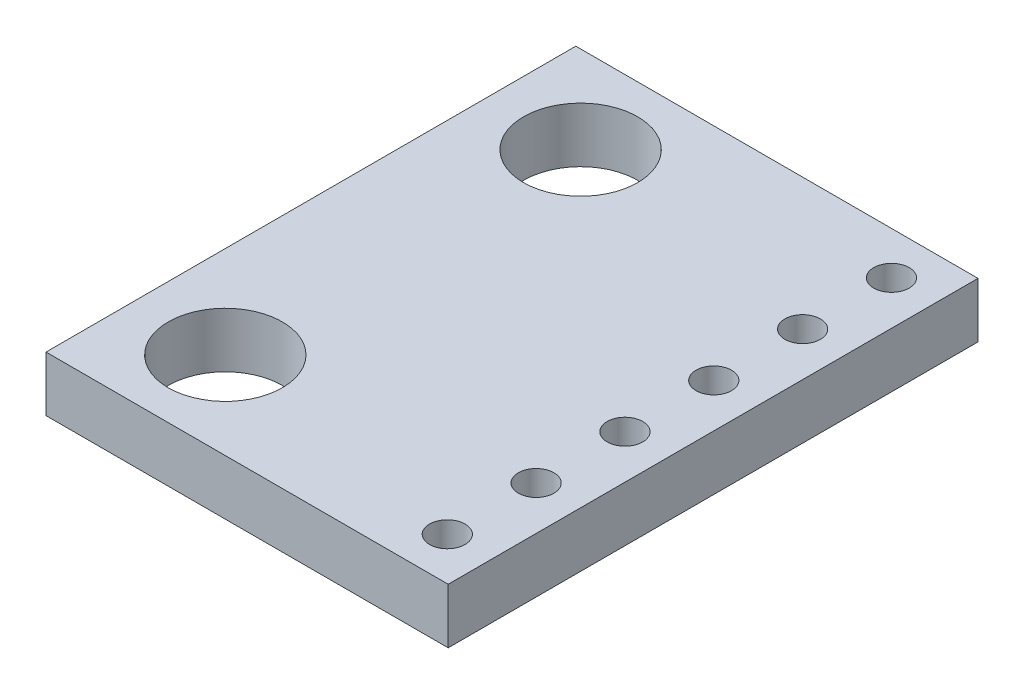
ISO-10303-21;
HEADER;
FILE_DESCRIPTION(('STEP AP214'),'2;1');
FILE_NAME('part.step','',(''),(''),'','','');
FILE_SCHEMA(('AUTOMOTIVE_DESIGN { 1 0 10303 214 1 1 1 1 }'));
ENDSEC;
DATA;
#1=APPLICATION_CONTEXT('core data for automotive mechanical design processes');
#2=APPLICATION_PROTOCOL_DEFINITION('international standard','automotive_design',2000,#1);
#3=PRODUCT_CONTEXT('',#1,'mechanical');
#4=PRODUCT('Part','Part','',(#3));
#5=PRODUCT_RELATED_PRODUCT_CATEGORY('part','',(#4));
#6=PRODUCT_DEFINITION_FORMATION('','',#4);
#7=PRODUCT_DEFINITION_CONTEXT('part definition',#1,'design');
#8=PRODUCT_DEFINITION('design','',#6,#7);
#9=PRODUCT_DEFINITION_SHAPE('','',#8);
#10=(LENGTH_UNIT() NAMED_UNIT(*) SI_UNIT(.MILLI.,.METRE.));
#11=(NAMED_UNIT(*) PLANE_ANGLE_UNIT() SI_UNIT($,.RADIAN.));
#12=(NAMED_UNIT(*) SI_UNIT($,.STERADIAN.) SOLID_ANGLE_UNIT());
#13=UNCERTAINTY_MEASURE_WITH_UNIT(LENGTH_MEASURE(1.E-05),#10,'distance_accuracy_value','');
#14=(GEOMETRIC_REPRESENTATION_CONTEXT(3) GLOBAL_UNCERTAINTY_ASSIGNED_CONTEXT((#13)) GLOBAL_UNIT_ASSIGNED_CONTEXT((#10,
#11,#12)) REPRESENTATION_CONTEXT('',''));
#15=CARTESIAN_POINT('',(0.,0.,0.));
#16=DIRECTION('',(0.,0.,1.));
#17=DIRECTION('',(1.,0.,0.));
#18=AXIS2_PLACEMENT_3D('',#15,#16,#17);
#19=CARTESIAN_POINT('',(0.,1.5748,0.));
#20=DIRECTION('',(0.,-1.,0.));
#21=DIRECTION('',(0.,0.,-1.));
#22=AXIS2_PLACEMENT_3D('',#19,#20,#21);
#23=PLANE('',#22);
#24=DIRECTION('',(0.,0.,1.));
#25=VECTOR('',#24,1.);
#26=CARTESIAN_POINT('',(0.,1.5748,0.));
#27=LINE('',#26,#25);
#28=CARTESIAN_POINT('',(0.,1.5748,-15.15));
#29=VERTEX_POINT('',#28);
#30=CARTESIAN_POINT('',(0.,1.5748,0.));
#31=VERTEX_POINT('',#30);
#32=EDGE_CURVE('E94',#29,#31,#27,.T.);
#33=ORIENTED_EDGE('',*,*,#32,.T.);
#34=DIRECTION('',(1.,0.,0.));
#35=VECTOR('',#34,1.);
#36=CARTESIAN_POINT('',(0.,1.5748,0.));
#37=LINE('',#36,#35);
#38=CARTESIAN_POINT('',(11.5,1.5748,0.));
#39=VERTEX_POINT('',#38);
#40=EDGE_CURVE('E89',#31,#39,#37,.T.);
#41=ORIENTED_EDGE('',*,*,#40,.T.);
#42=DIRECTION('',(0.,0.,-1.));
#43=VECTOR('',#42,1.);
#44=CARTESIAN_POINT('',(11.5,1.5748,0.));
#45=LINE('',#44,#43);
#46=CARTESIAN_POINT('',(11.5,1.5748,-15.15));
#47=VERTEX_POINT('',#46);
#48=EDGE_CURVE('E92',#39,#47,#45,.T.);
#49=ORIENTED_EDGE('',*,*,#48,.T.);
#50=DIRECTION('',(-1.,0.,0.));
#51=VECTOR('',#50,1.);
#52=CARTESIAN_POINT('',(0.,1.5748,-15.15));
#53=LINE('',#52,#51);
#54=EDGE_CURVE('E59',#47,#29,#53,.T.);
#55=ORIENTED_EDGE('',*,*,#54,.T.);
#56=EDGE_LOOP('',(#33,#41,#49,#55));
#57=FACE_BOUND('',#56,.T.);
#58=CARTESIAN_POINT('',(2.63195,1.5748,-12.655));
#59=DIRECTION('',(0.,1.,0.));
#60=DIRECTION('',(0.,0.,1.));
#61=AXIS2_PLACEMENT_3D('',#58,#59,#60);
#62=CIRCLE('',#61,1.63195);
#63=CARTESIAN_POINT('',(2.63195,1.5748,-11.02305));
#64=VERTEX_POINT('',#63);
#65=EDGE_CURVE('E109',#64,#64,#62,.T.);
#66=ORIENTED_EDGE('',*,*,#65,.F.);
#67=EDGE_LOOP('',(#66));
#68=FACE_BOUND('',#67,.T.);
#69=CARTESIAN_POINT('',(2.63195,1.5748,-2.495));
#70=DIRECTION('',(0.,1.,0.));
#71=DIRECTION('',(0.,0.,1.));
#72=AXIS2_PLACEMENT_3D('',#69,#70,#71);
#73=CIRCLE('',#72,1.63195);
#74=CARTESIAN_POINT('',(2.63195,1.5748,-0.863049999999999));
#75=VERTEX_POINT('',#74);
#76=EDGE_CURVE('E124',#75,#75,#73,.T.);
#77=ORIENTED_EDGE('',*,*,#76,.F.);
#78=EDGE_LOOP('',(#77));
#79=FACE_BOUND('',#78,.T.);
#80=CARTESIAN_POINT('',(10.25,1.5748,-13.925));
#81=DIRECTION('',(0.,1.,0.));
#82=DIRECTION('',(0.,0.,1.));
#83=AXIS2_PLACEMENT_3D('',#80,#81,#82);
#84=CIRCLE('',#83,0.508);
#85=CARTESIAN_POINT('',(10.25,1.5748,-13.417));
#86=VERTEX_POINT('',#85);
#87=EDGE_CURVE('E130',#86,#86,#84,.T.);
#88=ORIENTED_EDGE('',*,*,#87,.F.);
#89=EDGE_LOOP('',(#88));
#90=FACE_BOUND('',#89,.T.);
#91=CARTESIAN_POINT('',(10.25,1.5748,-11.385));
#92=DIRECTION('',(0.,1.,0.));
#93=DIRECTION('',(0.,0.,1.));
#94=AXIS2_PLACEMENT_3D('',#91,#92,#93);
#95=CIRCLE('',#94,0.508);
#96=CARTESIAN_POINT('',(10.25,1.5748,-10.877));
#97=VERTEX_POINT('',#96);
#98=EDGE_CURVE('E136',#97,#97,#95,.T.);
#99=ORIENTED_EDGE('',*,*,#98,.F.);
#100=EDGE_LOOP('',(#99));
#101=FACE_BOUND('',#100,.T.);
#102=CARTESIAN_POINT('',(10.25,1.5748,-8.845));
#103=DIRECTION('',(0.,1.,0.));
#104=DIRECTION('',(0.,0.,1.));
#105=AXIS2_PLACEMENT_3D('',#102,#103,#104);
#106=CIRCLE('',#105,0.508);
#107=CARTESIAN_POINT('',(10.25,1.5748,-8.337));
#108=VERTEX_POINT('',#107);
#109=EDGE_CURVE('E142',#108,#108,#106,.T.);
#110=ORIENTED_EDGE('',*,*,#109,.F.);
#111=EDGE_LOOP('',(#110));
#112=FACE_BOUND('',#111,.T.);
#113=CARTESIAN_POINT('',(10.25,1.5748,-6.305));
#114=DIRECTION('',(0.,1.,0.));
#115=DIRECTION('',(0.,0.,1.));
#116=AXIS2_PLACEMENT_3D('',#113,#114,#115);
#117=CIRCLE('',#116,0.508);
#118=CARTESIAN_POINT('',(10.25,1.5748,-5.797));
#119=VERTEX_POINT('',#118);
#120=EDGE_CURVE('E148',#119,#119,#117,.T.);
#121=ORIENTED_EDGE('',*,*,#120,.F.);
#122=EDGE_LOOP('',(#121));
#123=FACE_BOUND('',#122,.T.);
#124=CARTESIAN_POINT('',(10.25,1.5748,-3.765));
#125=DIRECTION('',(0.,1.,0.));
#126=DIRECTION('',(0.,0.,1.));
#127=AXIS2_PLACEMENT_3D('',#124,#125,#126);
#128=CIRCLE('',#127,0.508);
#129=CARTESIAN_POINT('',(10.25,1.5748,-3.257));
#130=VERTEX_POINT('',#129);
#131=EDGE_CURVE('E154',#130,#130,#128,.T.);
#132=ORIENTED_EDGE('',*,*,#131,.F.);
#133=EDGE_LOOP('',(#132));
#134=FACE_BOUND('',#133,.T.);
#135=CARTESIAN_POINT('',(10.25,1.5748,-1.225));
#136=DIRECTION('',(0.,1.,0.));
#137=DIRECTION('',(0.,0.,1.));
#138=AXIS2_PLACEMENT_3D('',#135,#136,#137);
#139=CIRCLE('',#138,0.508);
#140=CARTESIAN_POINT('',(10.25,1.5748,-0.717));
#141=VERTEX_POINT('',#140);
#142=EDGE_CURVE('E160',#141,#141,#139,.T.);
#143=ORIENTED_EDGE('',*,*,#142,.F.);
#144=EDGE_LOOP('',(#143));
#145=FACE_BOUND('',#144,.T.);
#146=ADVANCED_FACE('F42',(#57,#68,#79,#90,#101,#112,#123,#134,#145),#23,.F.);
#147=CARTESIAN_POINT('',(0.,0.,0.));
#148=DIRECTION('',(0.,-1.,0.));
#149=DIRECTION('',(0.,0.,-1.));
#150=AXIS2_PLACEMENT_3D('',#147,#148,#149);
#151=PLANE('',#150);
#152=CARTESIAN_POINT('',(10.25,0.,-3.765));
#153=DIRECTION('',(0.,1.,0.));
#154=DIRECTION('',(0.,0.,1.));
#155=AXIS2_PLACEMENT_3D('',#152,#153,#154);
#156=CIRCLE('',#155,0.508);
#157=CARTESIAN_POINT('',(10.25,0.,-3.257));
#158=VERTEX_POINT('',#157);
#159=EDGE_CURVE('E157',#158,#158,#156,.T.);
#160=ORIENTED_EDGE('',*,*,#159,.T.);
#161=EDGE_LOOP('',(#160));
#162=FACE_BOUND('',#161,.T.);
#163=CARTESIAN_POINT('',(10.25,0.,-8.845));
#164=DIRECTION('',(0.,1.,0.));
#165=DIRECTION('',(0.,0.,1.));
#166=AXIS2_PLACEMENT_3D('',#163,#164,#165);
#167=CIRCLE('',#166,0.508);
#168=CARTESIAN_POINT('',(10.25,0.,-8.337));
#169=VERTEX_POINT('',#168);
#170=EDGE_CURVE('E145',#169,#169,#167,.T.);
#171=ORIENTED_EDGE('',*,*,#170,.T.);
#172=EDGE_LOOP('',(#171));
#173=FACE_BOUND('',#172,.T.);
#174=CARTESIAN_POINT('',(10.25,0.,-13.925));
#175=DIRECTION('',(0.,1.,0.));
#176=DIRECTION('',(0.,0.,1.));
#177=AXIS2_PLACEMENT_3D('',#174,#175,#176);
#178=CIRCLE('',#177,0.508);
#179=CARTESIAN_POINT('',(10.25,0.,-13.417));
#180=VERTEX_POINT('',#179);
#181=EDGE_CURVE('E133',#180,#180,#178,.T.);
#182=ORIENTED_EDGE('',*,*,#181,.T.);
#183=EDGE_LOOP('',(#182));
#184=FACE_BOUND('',#183,.T.);
#185=CARTESIAN_POINT('',(2.63195,0.,-12.655));
#186=DIRECTION('',(0.,1.,0.));
#187=DIRECTION('',(0.,0.,1.));
#188=AXIS2_PLACEMENT_3D('',#185,#186,#187);
#189=CIRCLE('',#188,1.63195);
#190=CARTESIAN_POINT('',(2.63195,0.,-11.02305));
#191=VERTEX_POINT('',#190);
#192=EDGE_CURVE('E121',#191,#191,#189,.T.);
#193=ORIENTED_EDGE('',*,*,#192,.T.);
#194=EDGE_LOOP('',(#193));
#195=FACE_BOUND('',#194,.T.);
#196=DIRECTION('',(0.,0.,1.));
#197=VECTOR('',#196,1.);
#198=CARTESIAN_POINT('',(0.,0.,0.));
#199=LINE('',#198,#197);
#200=CARTESIAN_POINT('',(0.,0.,-15.15));
#201=VERTEX_POINT('',#200);
#202=CARTESIAN_POINT('',(0.,0.,0.));
#203=VERTEX_POINT('',#202);
#204=EDGE_CURVE('E106',#201,#203,#199,.T.);
#205=ORIENTED_EDGE('',*,*,#204,.F.);
#206=DIRECTION('',(-1.,0.,0.));
#207=VECTOR('',#206,1.);
#208=CARTESIAN_POINT('',(0.,0.,-15.15));
#209=LINE('',#208,#207);
#210=CARTESIAN_POINT('',(11.5,0.,-15.15));
#211=VERTEX_POINT('',#210);
#212=EDGE_CURVE('E82',#211,#201,#209,.T.);
#213=ORIENTED_EDGE('',*,*,#212,.F.);
#214=DIRECTION('',(0.,0.,-1.));
#215=VECTOR('',#214,1.);
#216=CARTESIAN_POINT('',(11.5,0.,0.));
#217=LINE('',#216,#215);
#218=CARTESIAN_POINT('',(11.5,0.,0.));
#219=VERTEX_POINT('',#218);
#220=EDGE_CURVE('E76',#219,#211,#217,.T.);
#221=ORIENTED_EDGE('',*,*,#220,.F.);
#222=DIRECTION('',(1.,0.,0.));
#223=VECTOR('',#222,1.);
#224=CARTESIAN_POINT('',(0.,0.,0.));
#225=LINE('',#224,#223);
#226=EDGE_CURVE('E98',#203,#219,#225,.T.);
#227=ORIENTED_EDGE('',*,*,#226,.F.);
#228=EDGE_LOOP('',(#205,#213,#221,#227));
#229=FACE_BOUND('',#228,.T.);
#230=CARTESIAN_POINT('',(2.63195,0.,-2.495));
#231=DIRECTION('',(0.,1.,0.));
#232=DIRECTION('',(0.,0.,1.));
#233=AXIS2_PLACEMENT_3D('',#230,#231,#232);
#234=CIRCLE('',#233,1.63195);
#235=CARTESIAN_POINT('',(2.63195,0.,-0.863049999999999));
#236=VERTEX_POINT('',#235);
#237=EDGE_CURVE('E127',#236,#236,#234,.T.);
#238=ORIENTED_EDGE('',*,*,#237,.T.);
#239=EDGE_LOOP('',(#238));
#240=FACE_BOUND('',#239,.T.);
#241=CARTESIAN_POINT('',(10.25,0.,-11.385));
#242=DIRECTION('',(0.,1.,0.));
#243=DIRECTION('',(0.,0.,1.));
#244=AXIS2_PLACEMENT_3D('',#241,#242,#243);
#245=CIRCLE('',#244,0.508);
#246=CARTESIAN_POINT('',(10.25,0.,-10.877));
#247=VERTEX_POINT('',#246);
#248=EDGE_CURVE('E139',#247,#247,#245,.T.);
#249=ORIENTED_EDGE('',*,*,#248,.T.);
#250=EDGE_LOOP('',(#249));
#251=FACE_BOUND('',#250,.T.);
#252=CARTESIAN_POINT('',(10.25,0.,-6.305));
#253=DIRECTION('',(0.,1.,0.));
#254=DIRECTION('',(0.,0.,1.));
#255=AXIS2_PLACEMENT_3D('',#252,#253,#254);
#256=CIRCLE('',#255,0.508);
#257=CARTESIAN_POINT('',(10.25,0.,-5.797));
#258=VERTEX_POINT('',#257);
#259=EDGE_CURVE('E151',#258,#258,#256,.T.);
#260=ORIENTED_EDGE('',*,*,#259,.T.);
#261=EDGE_LOOP('',(#260));
#262=FACE_BOUND('',#261,.T.);
#263=CARTESIAN_POINT('',(10.25,0.,-1.225));
#264=DIRECTION('',(0.,1.,0.));
#265=DIRECTION('',(0.,0.,1.));
#266=AXIS2_PLACEMENT_3D('',#263,#264,#265);
#267=CIRCLE('',#266,0.508);
#268=CARTESIAN_POINT('',(10.25,0.,-0.717));
#269=VERTEX_POINT('',#268);
#270=EDGE_CURVE('E163',#269,#269,#267,.T.);
#271=ORIENTED_EDGE('',*,*,#270,.T.);
#272=EDGE_LOOP('',(#271));
#273=FACE_BOUND('',#272,.T.);
#274=ADVANCED_FACE('F117',(#162,#173,#184,#195,#229,#240,#251,#262,#273),#151,.T.);
#275=CARTESIAN_POINT('',(0.,1.5748,0.));
#276=DIRECTION('',(1.,0.,0.));
#277=DIRECTION('',(0.,0.,-1.));
#278=AXIS2_PLACEMENT_3D('',#275,#276,#277);
#279=PLANE('',#278);
#280=ORIENTED_EDGE('',*,*,#204,.T.);
#281=DIRECTION('',(0.,-1.,0.));
#282=VECTOR('',#281,1.);
#283=CARTESIAN_POINT('',(0.,1.5748,0.));
#284=LINE('',#283,#282);
#285=EDGE_CURVE('E11',#31,#203,#284,.T.);
#286=ORIENTED_EDGE('',*,*,#285,.F.);
#287=ORIENTED_EDGE('',*,*,#32,.F.);
#288=DIRECTION('',(0.,-1.,0.));
#289=VECTOR('',#288,1.);
#290=CARTESIAN_POINT('',(0.,1.5748,-15.15));
#291=LINE('',#290,#289);
#292=EDGE_CURVE('E102',#29,#201,#291,.T.);
#293=ORIENTED_EDGE('',*,*,#292,.T.);
#294=EDGE_LOOP('',(#280,#286,#287,#293));
#295=FACE_BOUND('',#294,.T.);
#296=ADVANCED_FACE('F44',(#295),#279,.F.);
#297=CARTESIAN_POINT('',(0.,1.5748,0.));
#298=DIRECTION('',(0.,0.,-1.));
#299=DIRECTION('',(-1.,0.,0.));
#300=AXIS2_PLACEMENT_3D('',#297,#298,#299);
#301=PLANE('',#300);
#302=ORIENTED_EDGE('',*,*,#226,.T.);
#303=DIRECTION('',(0.,-1.,0.));
#304=VECTOR('',#303,1.);
#305=CARTESIAN_POINT('',(11.5,1.5748,0.));
#306=LINE('',#305,#304);
#307=EDGE_CURVE('E51',#39,#219,#306,.T.);
#308=ORIENTED_EDGE('',*,*,#307,.F.);
#309=ORIENTED_EDGE('',*,*,#40,.F.);
#310=ORIENTED_EDGE('',*,*,#285,.T.);
#311=EDGE_LOOP('',(#302,#308,#309,#310));
#312=FACE_BOUND('',#311,.T.);
#313=ADVANCED_FACE('F97',(#312),#301,.F.);
#314=CARTESIAN_POINT('',(11.5,1.5748,0.));
#315=DIRECTION('',(-1.,0.,0.));
#316=DIRECTION('',(0.,0.,1.));
#317=AXIS2_PLACEMENT_3D('',#314,#315,#316);
#318=PLANE('',#317);
#319=ORIENTED_EDGE('',*,*,#220,.T.);
#320=DIRECTION('',(0.,-1.,0.));
#321=VECTOR('',#320,1.);
#322=CARTESIAN_POINT('',(11.5,1.5748,-15.15));
#323=LINE('',#322,#321);
#324=EDGE_CURVE('E99',#47,#211,#323,.T.);
#325=ORIENTED_EDGE('',*,*,#324,.F.);
#326=ORIENTED_EDGE('',*,*,#48,.F.);
#327=ORIENTED_EDGE('',*,*,#307,.T.);
#328=EDGE_LOOP('',(#319,#325,#326,#327));
#329=FACE_BOUND('',#328,.T.);
#330=ADVANCED_FACE('F100',(#329),#318,.F.);
#331=CARTESIAN_POINT('',(0.,1.5748,-15.15));
#332=DIRECTION('',(0.,0.,1.));
#333=DIRECTION('',(1.,0.,0.));
#334=AXIS2_PLACEMENT_3D('',#331,#332,#333);
#335=PLANE('',#334);
#336=ORIENTED_EDGE('',*,*,#212,.T.);
#337=ORIENTED_EDGE('',*,*,#292,.F.);
#338=ORIENTED_EDGE('',*,*,#54,.F.);
#339=ORIENTED_EDGE('',*,*,#324,.T.);
#340=EDGE_LOOP('',(#336,#337,#338,#339));
#341=FACE_BOUND('',#340,.T.);
#342=ADVANCED_FACE('F114',(#341),#335,.F.);
#343=CARTESIAN_POINT('',(2.63195,1.5748,-12.655));
#344=DIRECTION('',(0.,-1.,0.));
#345=DIRECTION('',(0.,0.,-1.));
#346=AXIS2_PLACEMENT_3D('',#343,#344,#345);
#347=CYLINDRICAL_SURFACE('',#346,1.63195);
#348=ORIENTED_EDGE('',*,*,#65,.T.);
#349=EDGE_LOOP('',(#348));
#350=FACE_BOUND('',#349,.T.);
#351=ORIENTED_EDGE('',*,*,#192,.F.);
#352=EDGE_LOOP('',(#351));
#353=FACE_BOUND('',#352,.T.);
#354=ADVANCED_FACE('F180',(#350,#353),#347,.F.);
#355=CARTESIAN_POINT('',(2.63195,1.5748,-2.495));
#356=DIRECTION('',(0.,-1.,0.));
#357=DIRECTION('',(0.,0.,-1.));
#358=AXIS2_PLACEMENT_3D('',#355,#356,#357);
#359=CYLINDRICAL_SURFACE('',#358,1.63195);
#360=ORIENTED_EDGE('',*,*,#76,.T.);
#361=EDGE_LOOP('',(#360));
#362=FACE_BOUND('',#361,.T.);
#363=ORIENTED_EDGE('',*,*,#237,.F.);
#364=EDGE_LOOP('',(#363));
#365=FACE_BOUND('',#364,.T.);
#366=ADVANCED_FACE('F225',(#362,#365),#359,.F.);
#367=CARTESIAN_POINT('',(10.25,1.5748,-13.925));
#368=DIRECTION('',(0.,-1.,0.));
#369=DIRECTION('',(0.,0.,-1.));
#370=AXIS2_PLACEMENT_3D('',#367,#368,#369);
#371=CYLINDRICAL_SURFACE('',#370,0.508);
#372=ORIENTED_EDGE('',*,*,#87,.T.);
#373=EDGE_LOOP('',(#372));
#374=FACE_BOUND('',#373,.T.);
#375=ORIENTED_EDGE('',*,*,#181,.F.);
#376=EDGE_LOOP('',(#375));
#377=FACE_BOUND('',#376,.T.);
#378=ADVANCED_FACE('F233',(#374,#377),#371,.F.);
#379=CARTESIAN_POINT('',(10.25,1.5748,-11.385));
#380=DIRECTION('',(0.,-1.,0.));
#381=DIRECTION('',(0.,0.,-1.));
#382=AXIS2_PLACEMENT_3D('',#379,#380,#381);
#383=CYLINDRICAL_SURFACE('',#382,0.508);
#384=ORIENTED_EDGE('',*,*,#98,.T.);
#385=EDGE_LOOP('',(#384));
#386=FACE_BOUND('',#385,.T.);
#387=ORIENTED_EDGE('',*,*,#248,.F.);
#388=EDGE_LOOP('',(#387));
#389=FACE_BOUND('',#388,.T.);
#390=ADVANCED_FACE('F241',(#386,#389),#383,.F.);
#391=CARTESIAN_POINT('',(10.25,1.5748,-8.845));
#392=DIRECTION('',(0.,-1.,0.));
#393=DIRECTION('',(0.,0.,-1.));
#394=AXIS2_PLACEMENT_3D('',#391,#392,#393);
#395=CYLINDRICAL_SURFACE('',#394,0.508);
#396=ORIENTED_EDGE('',*,*,#109,.T.);
#397=EDGE_LOOP('',(#396));
#398=FACE_BOUND('',#397,.T.);
#399=ORIENTED_EDGE('',*,*,#170,.F.);
#400=EDGE_LOOP('',(#399));
#401=FACE_BOUND('',#400,.T.);
#402=ADVANCED_FACE('F250',(#398,#401),#395,.F.);
#403=CARTESIAN_POINT('',(10.25,1.5748,-6.305));
#404=DIRECTION('',(0.,-1.,0.));
#405=DIRECTION('',(0.,0.,-1.));
#406=AXIS2_PLACEMENT_3D('',#403,#404,#405);
#407=CYLINDRICAL_SURFACE('',#406,0.508);
#408=ORIENTED_EDGE('',*,*,#120,.T.);
#409=EDGE_LOOP('',(#408));
#410=FACE_BOUND('',#409,.T.);
#411=ORIENTED_EDGE('',*,*,#259,.F.);
#412=EDGE_LOOP('',(#411));
#413=FACE_BOUND('',#412,.T.);
#414=ADVANCED_FACE('F259',(#410,#413),#407,.F.);
#415=CARTESIAN_POINT('',(10.25,1.5748,-3.765));
#416=DIRECTION('',(0.,-1.,0.));
#417=DIRECTION('',(0.,0.,-1.));
#418=AXIS2_PLACEMENT_3D('',#415,#416,#417);
#419=CYLINDRICAL_SURFACE('',#418,0.508);
#420=ORIENTED_EDGE('',*,*,#131,.T.);
#421=EDGE_LOOP('',(#420));
#422=FACE_BOUND('',#421,.T.);
#423=ORIENTED_EDGE('',*,*,#159,.F.);
#424=EDGE_LOOP('',(#423));
#425=FACE_BOUND('',#424,.T.);
#426=ADVANCED_FACE('F268',(#422,#425),#419,.F.);
#427=CARTESIAN_POINT('',(10.25,1.5748,-1.225));
#428=DIRECTION('',(0.,-1.,0.));
#429=DIRECTION('',(0.,0.,-1.));
#430=AXIS2_PLACEMENT_3D('',#427,#428,#429);
#431=CYLINDRICAL_SURFACE('',#430,0.508);
#432=ORIENTED_EDGE('',*,*,#142,.T.);
#433=EDGE_LOOP('',(#432));
#434=FACE_BOUND('',#433,.T.);
#435=ORIENTED_EDGE('',*,*,#270,.F.);
#436=EDGE_LOOP('',(#435));
#437=FACE_BOUND('',#436,.T.);
#438=ADVANCED_FACE('F169',(#434,#437),#431,.F.);
#439=CLOSED_SHELL('',(#146,#274,#296,#313,#330,#342,#354,#366,#378,#390,#402,#414,#426,#438));
#440=MANIFOLD_SOLID_BREP('B2',#439);
#441=ADVANCED_BREP_SHAPE_REPRESENTATION('',(#18,#440),#14);
#442=SHAPE_DEFINITION_REPRESENTATION(#9,#441);
ENDSEC;
END-ISO-10303-21;
